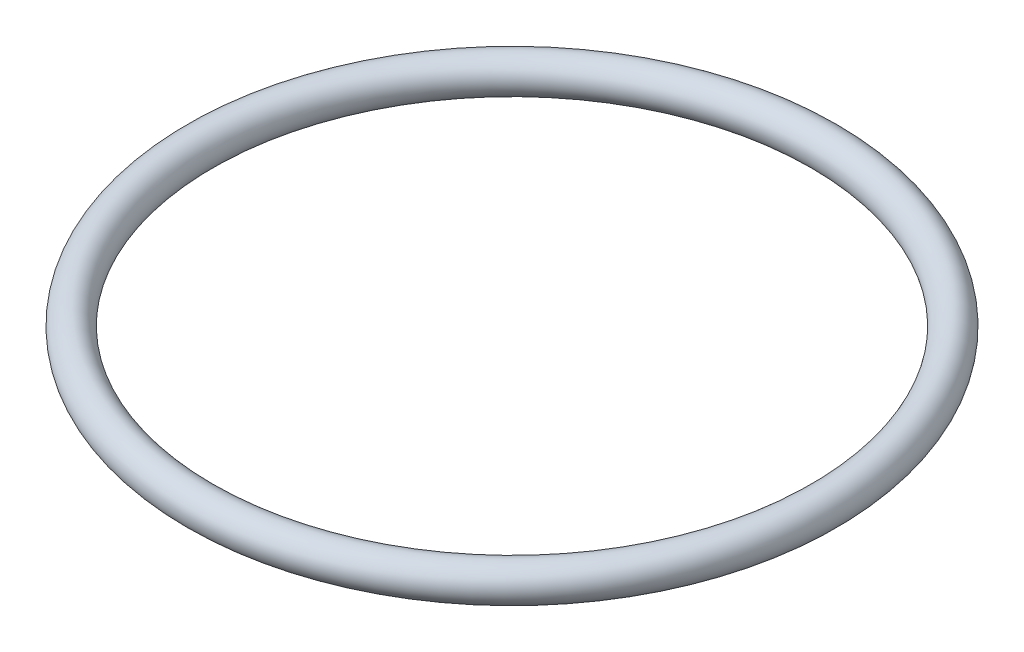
ISO-10303-21;
HEADER;
FILE_DESCRIPTION(('STEP AP214'),'2;1');
FILE_NAME('part.step','',(''),(''),'','','');
FILE_SCHEMA(('AUTOMOTIVE_DESIGN { 1 0 10303 214 1 1 1 1 }'));
ENDSEC;
DATA;
#1=APPLICATION_CONTEXT('core data for automotive mechanical design processes');
#2=APPLICATION_PROTOCOL_DEFINITION('international standard','automotive_design',2000,#1);
#3=PRODUCT_CONTEXT('',#1,'mechanical');
#4=PRODUCT('Part','Part','',(#3));
#5=PRODUCT_RELATED_PRODUCT_CATEGORY('part','',(#4));
#6=PRODUCT_DEFINITION_FORMATION('','',#4);
#7=PRODUCT_DEFINITION_CONTEXT('part definition',#1,'design');
#8=PRODUCT_DEFINITION('design','',#6,#7);
#9=PRODUCT_DEFINITION_SHAPE('','',#8);
#10=(LENGTH_UNIT() NAMED_UNIT(*) SI_UNIT(.MILLI.,.METRE.));
#11=(NAMED_UNIT(*) PLANE_ANGLE_UNIT() SI_UNIT($,.RADIAN.));
#12=(NAMED_UNIT(*) SI_UNIT($,.STERADIAN.) SOLID_ANGLE_UNIT());
#13=UNCERTAINTY_MEASURE_WITH_UNIT(LENGTH_MEASURE(1.E-05),#10,'distance_accuracy_value','');
#14=(GEOMETRIC_REPRESENTATION_CONTEXT(3) GLOBAL_UNCERTAINTY_ASSIGNED_CONTEXT((#13)) GLOBAL_UNIT_ASSIGNED_CONTEXT((#10,
#11,#12)) REPRESENTATION_CONTEXT('',''));
#15=CARTESIAN_POINT('',(0.,0.,0.));
#16=DIRECTION('',(0.,0.,1.));
#17=DIRECTION('',(1.,0.,0.));
#18=AXIS2_PLACEMENT_3D('',#15,#16,#17);
#19=CARTESIAN_POINT('',(0.,0.,0.));
#20=DIRECTION('',(0.,1.,0.));
#21=DIRECTION('',(0.,0.,1.));
#22=AXIS2_PLACEMENT_3D('',#19,#20,#21);
#23=TOROIDAL_SURFACE('',#22,17.5,1.);
#24=CARTESIAN_POINT('',(0.,0.,18.5));
#25=VERTEX_POINT('',#24);
#26=VERTEX_LOOP('',#25);
#27=FACE_BOUND('',#26,.T.);
#28=ADVANCED_FACE('F27',(#27),#23,.T.);
#29=CLOSED_SHELL('',(#28));
#30=MANIFOLD_SOLID_BREP('B2',#29);
#31=ADVANCED_BREP_SHAPE_REPRESENTATION('',(#18,#30),#14);
#32=SHAPE_DEFINITION_REPRESENTATION(#9,#31);
ENDSEC;
END-ISO-10303-21;
